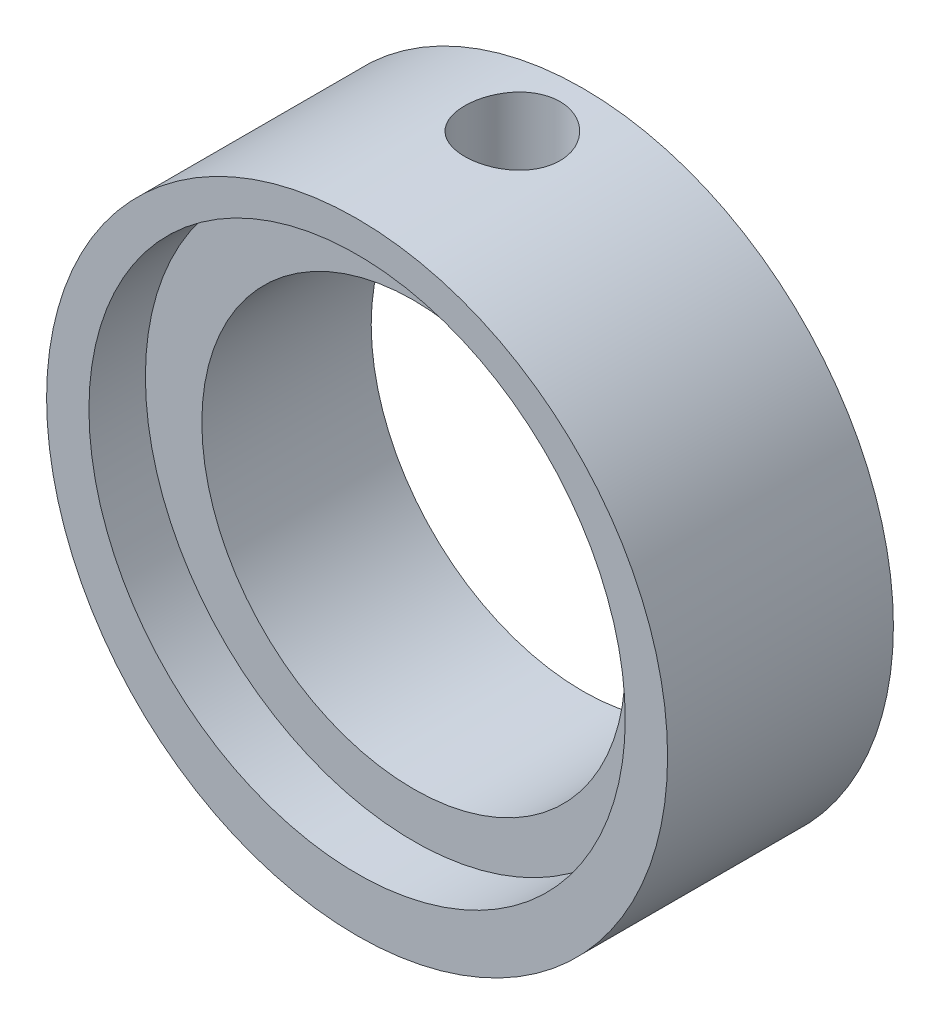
ISO-10303-21;
HEADER;
FILE_DESCRIPTION(('STEP AP214'),'2;1');
FILE_NAME('part.step','',(''),(''),'','','');
FILE_SCHEMA(('AUTOMOTIVE_DESIGN { 1 0 10303 214 1 1 1 1 }'));
ENDSEC;
DATA;
#1=APPLICATION_CONTEXT('core data for automotive mechanical design processes');
#2=APPLICATION_PROTOCOL_DEFINITION('international standard','automotive_design',2000,#1);
#3=PRODUCT_CONTEXT('',#1,'mechanical');
#4=PRODUCT('Part','Part','',(#3));
#5=PRODUCT_RELATED_PRODUCT_CATEGORY('part','',(#4));
#6=PRODUCT_DEFINITION_FORMATION('','',#4);
#7=PRODUCT_DEFINITION_CONTEXT('part definition',#1,'design');
#8=PRODUCT_DEFINITION('design','',#6,#7);
#9=PRODUCT_DEFINITION_SHAPE('','',#8);
#10=(LENGTH_UNIT() NAMED_UNIT(*) SI_UNIT(.MILLI.,.METRE.));
#11=(NAMED_UNIT(*) PLANE_ANGLE_UNIT() SI_UNIT($,.RADIAN.));
#12=(NAMED_UNIT(*) SI_UNIT($,.STERADIAN.) SOLID_ANGLE_UNIT());
#13=UNCERTAINTY_MEASURE_WITH_UNIT(LENGTH_MEASURE(1.E-05),#10,'distance_accuracy_value','');
#14=(GEOMETRIC_REPRESENTATION_CONTEXT(3) GLOBAL_UNCERTAINTY_ASSIGNED_CONTEXT((#13)) GLOBAL_UNIT_ASSIGNED_CONTEXT((#10,
#11,#12)) REPRESENTATION_CONTEXT('',''));
#15=CARTESIAN_POINT('',(0.,0.,0.));
#16=DIRECTION('',(0.,0.,1.));
#17=DIRECTION('',(1.,0.,0.));
#18=AXIS2_PLACEMENT_3D('',#15,#16,#17);
#19=CARTESIAN_POINT('',(0.,0.,16.));
#20=DIRECTION('',(0.,0.,-1.));
#21=DIRECTION('',(-1.,0.,0.));
#22=AXIS2_PLACEMENT_3D('',#19,#20,#21);
#23=CYLINDRICAL_SURFACE('',#22,15.);
#24=CARTESIAN_POINT('',(0.,0.,12.));
#25=DIRECTION('',(0.,0.,1.));
#26=DIRECTION('',(1.,0.,0.));
#27=AXIS2_PLACEMENT_3D('',#24,#25,#26);
#28=CIRCLE('',#27,15.);
#29=CARTESIAN_POINT('',(15.,0.,12.));
#30=VERTEX_POINT('',#29);
#31=EDGE_CURVE('E58',#30,#30,#28,.T.);
#32=ORIENTED_EDGE('',*,*,#31,.T.);
#33=EDGE_LOOP('',(#32));
#34=FACE_BOUND('',#33,.T.);
#35=CARTESIAN_POINT('',(0.,0.,0.));
#36=DIRECTION('',(0.,0.,1.));
#37=DIRECTION('',(1.,0.,0.));
#38=AXIS2_PLACEMENT_3D('',#35,#36,#37);
#39=CIRCLE('',#38,15.);
#40=CARTESIAN_POINT('',(15.,0.,0.));
#41=VERTEX_POINT('',#40);
#42=EDGE_CURVE('E47',#41,#41,#39,.T.);
#43=ORIENTED_EDGE('',*,*,#42,.F.);
#44=EDGE_LOOP('',(#43));
#45=FACE_BOUND('',#44,.T.);
#46=CARTESIAN_POINT('',(0.,15.,1.625));
#47=CARTESIAN_POINT('',(-0.187049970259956,14.9999965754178,1.62500619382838));
#48=CARTESIAN_POINT('',(-0.374173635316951,14.9964658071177,1.6406025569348));
#49=CARTESIAN_POINT('',(-0.743096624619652,14.9827220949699,1.70250573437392));
#50=CARTESIAN_POINT('',(-0.924892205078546,14.9725045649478,1.74883362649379));
#51=CARTESIAN_POINT('',(-1.27777480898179,14.9465237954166,1.87066811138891));
#52=CARTESIAN_POINT('',(-1.44887311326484,14.9307665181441,1.94614334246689));
#53=CARTESIAN_POINT('',(-1.77597364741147,14.8954025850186,2.12402838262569));
#54=CARTESIAN_POINT('',(-1.93197609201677,14.8757959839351,2.22643780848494));
#55=CARTESIAN_POINT('',(-2.22710112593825,14.8345066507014,2.45711745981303));
#56=CARTESIAN_POINT('',(-2.36593172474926,14.8127969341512,2.58575644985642));
#57=CARTESIAN_POINT('',(-2.62023917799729,14.76993620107,2.86445237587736));
#58=CARTESIAN_POINT('',(-2.73571385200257,14.7487852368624,3.01451130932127));
#59=CARTESIAN_POINT('',(-2.94133594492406,14.7091696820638,3.33396704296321));
#60=CARTESIAN_POINT('',(-3.03116951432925,14.6907396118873,3.50357052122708));
#61=CARTESIAN_POINT('',(-3.18094521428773,14.6590411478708,3.85595024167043));
#62=CARTESIAN_POINT('',(-3.24089114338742,14.6457720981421,4.0387248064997));
#63=CARTESIAN_POINT('',(-3.32821895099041,14.6261733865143,4.40908238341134));
#64=CARTESIAN_POINT('',(-3.35611938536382,14.6197333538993,4.59653715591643));
#65=CARTESIAN_POINT('',(-3.38017716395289,14.6141905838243,4.9735689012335));
#66=CARTESIAN_POINT('',(-3.37633864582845,14.6150868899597,5.16314559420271));
#67=CARTESIAN_POINT('',(-3.33744409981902,14.624015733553,5.53516251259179));
#68=CARTESIAN_POINT('',(-3.3029933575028,14.6319098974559,5.71766984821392));
#69=CARTESIAN_POINT('',(-3.20481250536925,14.653725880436,6.07424612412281));
#70=CARTESIAN_POINT('',(-3.14108066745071,14.6676480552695,6.24831456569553));
#71=CARTESIAN_POINT('',(-2.98559868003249,14.7000859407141,6.58475843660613));
#72=CARTESIAN_POINT('',(-2.89361830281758,14.7186391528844,6.74702370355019));
#73=CARTESIAN_POINT('',(-2.68441192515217,14.7582259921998,7.05403914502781));
#74=CARTESIAN_POINT('',(-2.56718229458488,14.7792599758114,7.19878679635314));
#75=CARTESIAN_POINT('',(-2.30761412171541,14.8220299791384,7.47014003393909));
#76=CARTESIAN_POINT('',(-2.16476159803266,14.8437710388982,7.59625367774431));
#77=CARTESIAN_POINT('',(-1.85968534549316,14.8850672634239,7.82281698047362));
#78=CARTESIAN_POINT('',(-1.6974612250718,14.9046223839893,7.92326612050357));
#79=CARTESIAN_POINT('',(-1.35762702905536,14.939412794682,8.09578163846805));
#80=CARTESIAN_POINT('',(-1.17998162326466,14.9546378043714,8.16778062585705));
#81=CARTESIAN_POINT('',(-0.814694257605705,14.978976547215,8.2807671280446));
#82=CARTESIAN_POINT('',(-0.627053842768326,14.988091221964,8.32175942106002));
#83=CARTESIAN_POINT('',(-0.251319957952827,14.9990472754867,8.37084660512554));
#84=CARTESIAN_POINT('',(-0.063318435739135,15.0010371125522,8.37961308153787));
#85=CARTESIAN_POINT('',(0.311463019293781,14.997936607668,8.36582421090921));
#86=CARTESIAN_POINT('',(0.498243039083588,14.9928467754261,8.34327111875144));
#87=CARTESIAN_POINT('',(0.863033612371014,14.9762528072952,8.26803967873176));
#88=CARTESIAN_POINT('',(1.04112111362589,14.9648242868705,8.21571628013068));
#89=CARTESIAN_POINT('',(1.38599025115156,14.9368333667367,8.08282564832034));
#90=CARTESIAN_POINT('',(1.5527708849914,14.9202705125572,8.00225591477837));
#91=CARTESIAN_POINT('',(1.87304917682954,14.883483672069,7.81377920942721));
#92=CARTESIAN_POINT('',(2.02631071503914,14.863208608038,7.70548119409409));
#93=CARTESIAN_POINT('',(2.31272577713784,14.8213456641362,7.46513408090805));
#94=CARTESIAN_POINT('',(2.44587652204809,14.7997576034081,7.33308170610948));
#95=CARTESIAN_POINT('',(2.69096738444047,14.7571847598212,7.04588481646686));
#96=CARTESIAN_POINT('',(2.80244117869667,14.7362200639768,6.89033880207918));
#97=CARTESIAN_POINT('',(2.99768862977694,14.6977483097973,6.56234047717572));
#98=CARTESIAN_POINT('',(3.08146350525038,14.6802410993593,6.38988891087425));
#99=CARTESIAN_POINT('',(3.21835399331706,14.6508396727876,6.03390992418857));
#100=CARTESIAN_POINT('',(3.27164531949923,14.6389133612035,5.85045285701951));
#101=CARTESIAN_POINT('',(3.34656287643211,14.6219704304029,5.47688292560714));
#102=CARTESIAN_POINT('',(3.36819451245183,14.6169526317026,5.28677120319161));
#103=CARTESIAN_POINT('',(3.37893828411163,14.6144722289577,4.90999803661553));
#104=CARTESIAN_POINT('',(3.36879081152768,14.6168376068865,4.72335846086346));
#105=CARTESIAN_POINT('',(3.31792710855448,14.6284663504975,4.35452253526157));
#106=CARTESIAN_POINT('',(3.27721128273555,14.6377296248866,4.17232612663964));
#107=CARTESIAN_POINT('',(3.16673365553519,14.6620241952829,3.81817789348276));
#108=CARTESIAN_POINT('',(3.09708556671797,14.6770328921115,3.64618894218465));
#109=CARTESIAN_POINT('',(2.93081601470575,14.7111348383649,3.31622936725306));
#110=CARTESIAN_POINT('',(2.83419155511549,14.730228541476,3.15826030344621));
#111=CARTESIAN_POINT('',(2.61428212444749,14.7708585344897,2.85718827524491));
#112=CARTESIAN_POINT('',(2.490472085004,14.7924382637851,2.71447462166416));
#113=CARTESIAN_POINT('',(2.22076251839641,14.8353235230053,2.45160683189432));
#114=CARTESIAN_POINT('',(2.07485787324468,14.8566289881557,2.33145793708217));
#115=CARTESIAN_POINT('',(1.76265478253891,14.8969170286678,2.11552454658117));
#116=CARTESIAN_POINT('',(1.59610099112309,14.9158631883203,2.0201020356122));
#117=CARTESIAN_POINT('',(1.24892247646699,14.9489294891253,1.85875905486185));
#118=CARTESIAN_POINT('',(1.06830937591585,14.9630535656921,1.79281451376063));
#119=CARTESIAN_POINT('',(0.7396697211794,14.9824450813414,1.70368423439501));
#120=CARTESIAN_POINT('',(0.593384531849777,14.9889865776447,1.67423531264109));
#121=CARTESIAN_POINT('',(0.298081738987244,14.9977652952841,1.63489121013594));
#122=CARTESIAN_POINT('',(0.149064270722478,15.0000027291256,1.62499506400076));
#123=CARTESIAN_POINT('',(0.,15.,1.625));
#124=B_SPLINE_CURVE_WITH_KNOTS('',3,(#46,#47,#48,#49,#50,#51,#52,#53,#54,#55,#56,#57,#58,#59,
#60,#61,#62,#63,#64,#65,#66,#67,#68,#69,#70,#71,#72,#73,#74,#75,#76,#77,#78,#79,#80,#81,#82,#83,
#84,#85,#86,#87,#88,#89,#90,#91,#92,#93,#94,#95,#96,#97,#98,#99,#100,#101,#102,#103,#104,#105,
#106,#107,#108,#109,#110,#111,#112,#113,#114,#115,#116,#117,#118,#119,#120,#121,#122,#123),
.UNSPECIFIED.,.T.,.F.,(4,2,2,2,2,2,2,2,2,2,2,2,2,2,2,2,2,2,2,2,2,2,2,2,2,2,2,2,2,2,2,2,2,2,2,2,
2,2,4),(0.,0.560604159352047,1.12159321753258,1.68198034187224,2.2423594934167,2.81124017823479,
3.38017394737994,3.95579900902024,4.53135089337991,5.09745190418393,5.66347911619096,
6.21855749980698,6.77366864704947,7.3334297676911,7.89327141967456,8.46594659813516,
9.038633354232,9.61266862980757,10.1866154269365,10.7485311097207,11.3104063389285,
11.8657186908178,12.4210802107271,12.9847523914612,13.5485023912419,14.1232900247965,
14.6980523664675,15.2694673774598,15.8407848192,16.3988915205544,16.9569908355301,
17.5129170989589,18.068905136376,18.6367612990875,19.2047492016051,19.7806343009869,
20.3560482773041,20.8028282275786,21.2495861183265),.UNSPECIFIED.);
#125=CARTESIAN_POINT('',(0.,15.,1.625));
#126=VERTEX_POINT('',#125);
#127=EDGE_CURVE('E61',#126,#126,#124,.T.);
#128=ORIENTED_EDGE('',*,*,#127,.T.);
#129=EDGE_LOOP('',(#128));
#130=FACE_BOUND('',#129,.T.);
#131=ADVANCED_FACE('F26',(#34,#45,#130),#23,.F.);
#132=CARTESIAN_POINT('',(0.,0.,16.));
#133=DIRECTION('',(0.,0.,-1.));
#134=DIRECTION('',(-1.,0.,0.));
#135=AXIS2_PLACEMENT_3D('',#132,#133,#134);
#136=CYLINDRICAL_SURFACE('',#135,22.);
#137=CARTESIAN_POINT('',(0.,0.,16.));
#138=DIRECTION('',(0.,0.,1.));
#139=DIRECTION('',(1.,0.,0.));
#140=AXIS2_PLACEMENT_3D('',#137,#138,#139);
#141=CIRCLE('',#140,22.);
#142=CARTESIAN_POINT('',(22.,0.,16.));
#143=VERTEX_POINT('',#142);
#144=EDGE_CURVE('E37',#143,#143,#141,.T.);
#145=ORIENTED_EDGE('',*,*,#144,.F.);
#146=EDGE_LOOP('',(#145));
#147=FACE_BOUND('',#146,.T.);
#148=CARTESIAN_POINT('',(0.,0.,0.));
#149=DIRECTION('',(0.,0.,1.));
#150=DIRECTION('',(1.,0.,0.));
#151=AXIS2_PLACEMENT_3D('',#148,#149,#150);
#152=CIRCLE('',#151,22.);
#153=CARTESIAN_POINT('',(22.,0.,0.));
#154=VERTEX_POINT('',#153);
#155=EDGE_CURVE('E42',#154,#154,#152,.T.);
#156=ORIENTED_EDGE('',*,*,#155,.T.);
#157=EDGE_LOOP('',(#156));
#158=FACE_BOUND('',#157,.T.);
#159=CARTESIAN_POINT('',(0.,22.,1.625));
#160=CARTESIAN_POINT('',(-0.188389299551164,21.999996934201,1.62500772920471));
#161=CARTESIAN_POINT('',(-0.376886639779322,21.9975548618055,1.64082682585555));
#162=CARTESIAN_POINT('',(-0.748609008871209,21.9880480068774,1.70366720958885));
#163=CARTESIAN_POINT('',(-0.931828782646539,21.9809787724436,1.75071854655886));
#164=CARTESIAN_POINT('',(-1.28756295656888,21.9630117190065,1.87458143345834));
#165=CARTESIAN_POINT('',(-1.46008546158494,21.952116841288,1.95137012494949));
#166=CARTESIAN_POINT('',(-1.78977112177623,21.9277012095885,2.13247130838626));
#167=CARTESIAN_POINT('',(-1.9469363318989,21.9141808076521,2.23678011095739));
#168=CARTESIAN_POINT('',(-2.24275340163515,21.8858934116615,2.47086674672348));
#169=CARTESIAN_POINT('',(-2.3812618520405,21.8711180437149,2.60082481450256));
#170=CARTESIAN_POINT('',(-2.63459605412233,21.8420512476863,2.8821330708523));
#171=CARTESIAN_POINT('',(-2.74942041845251,21.8277598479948,3.03348451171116));
#172=CARTESIAN_POINT('',(-2.95268854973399,21.8011978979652,3.3542510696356));
#173=CARTESIAN_POINT('',(-3.04099295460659,21.7889381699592,3.52375547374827));
#174=CARTESIAN_POINT('',(-3.18782380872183,21.7679423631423,3.87540971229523));
#175=CARTESIAN_POINT('',(-3.24635195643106,21.7592060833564,4.0575588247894));
#176=CARTESIAN_POINT('',(-3.33152222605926,21.7463288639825,4.42782126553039));
#177=CARTESIAN_POINT('',(-3.35841028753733,21.7421524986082,4.61587676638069));
#178=CARTESIAN_POINT('',(-3.38029915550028,21.7387604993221,4.99387325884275));
#179=CARTESIAN_POINT('',(-3.37530187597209,21.7395445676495,5.18381413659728));
#180=CARTESIAN_POINT('',(-3.33376277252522,21.7459524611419,5.55844873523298));
#181=CARTESIAN_POINT('',(-3.29749532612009,21.751534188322,5.74317370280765));
#182=CARTESIAN_POINT('',(-3.19487511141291,21.766842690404,6.10388506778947));
#183=CARTESIAN_POINT('',(-3.12852145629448,21.7765695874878,6.27987120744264));
#184=CARTESIAN_POINT('',(-2.96732840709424,21.7991187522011,6.61894148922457));
#185=CARTESIAN_POINT('',(-2.87237324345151,21.8119535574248,6.78196972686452));
#186=CARTESIAN_POINT('',(-2.6567550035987,21.8392633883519,7.08988265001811));
#187=CARTESIAN_POINT('',(-2.53609016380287,21.8537385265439,7.23476608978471));
#188=CARTESIAN_POINT('',(-2.27097389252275,21.8828838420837,7.50386651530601));
#189=CARTESIAN_POINT('',(-2.12628665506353,21.8975544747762,7.62785125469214));
#190=CARTESIAN_POINT('',(-1.81803519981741,21.9252971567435,7.84981477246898));
#191=CARTESIAN_POINT('',(-1.6544708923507,21.9383691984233,7.94779342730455));
#192=CARTESIAN_POINT('',(-1.31290363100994,21.9614564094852,8.11497726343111));
#193=CARTESIAN_POINT('',(-1.13489151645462,21.971469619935,8.18416401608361));
#194=CARTESIAN_POINT('',(-0.769587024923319,21.9872947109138,8.29159551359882));
#195=CARTESIAN_POINT('',(-0.582295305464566,21.9931068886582,8.32984244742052));
#196=CARTESIAN_POINT('',(-0.205752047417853,21.9998355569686,8.37399861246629));
#197=CARTESIAN_POINT('',(-0.0165387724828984,22.0008003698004,8.38022704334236));
#198=CARTESIAN_POINT('',(0.360229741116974,21.9978572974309,8.36101739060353));
#199=CARTESIAN_POINT('',(0.54778503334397,21.9939495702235,8.33558033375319));
#200=CARTESIAN_POINT('',(0.914942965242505,21.9817303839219,8.25402721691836));
#201=CARTESIAN_POINT('',(1.09458106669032,21.9734413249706,8.19806716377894));
#202=CARTESIAN_POINT('',(1.44192532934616,21.9533857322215,8.05722142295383));
#203=CARTESIAN_POINT('',(1.60963090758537,21.9416190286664,7.97233432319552));
#204=CARTESIAN_POINT('',(1.92974982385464,21.9157952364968,7.77529876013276));
#205=CARTESIAN_POINT('',(2.08203753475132,21.9017214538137,7.66294842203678));
#206=CARTESIAN_POINT('',(2.36571070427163,21.8729005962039,7.41445599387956));
#207=CARTESIAN_POINT('',(2.49709488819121,21.8581534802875,7.27831245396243));
#208=CARTESIAN_POINT('',(2.73639723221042,21.8294942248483,6.98467509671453));
#209=CARTESIAN_POINT('',(2.84410108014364,21.8155904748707,6.82700567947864));
#210=CARTESIAN_POINT('',(3.03149438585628,21.7903423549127,6.49562549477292));
#211=CARTESIAN_POINT('',(3.11118462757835,21.7789979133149,6.32191517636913));
#212=CARTESIAN_POINT('',(3.23995872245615,21.7602140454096,5.96401541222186));
#213=CARTESIAN_POINT('',(3.28915415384,21.7527603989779,5.77986689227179));
#214=CARTESIAN_POINT('',(3.35589652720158,21.7425646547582,5.40579808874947));
#215=CARTESIAN_POINT('',(3.37344576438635,21.7398222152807,5.21587822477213));
#216=CARTESIAN_POINT('',(3.37634113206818,21.7393725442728,4.83779471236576));
#217=CARTESIAN_POINT('',(3.36202429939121,21.7416126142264,4.64963362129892));
#218=CARTESIAN_POINT('',(3.30231746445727,21.7507608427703,4.27842941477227));
#219=CARTESIAN_POINT('',(3.25692752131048,21.7576689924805,4.09538628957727));
#220=CARTESIAN_POINT('',(3.13648408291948,21.7753562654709,3.73971461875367));
#221=CARTESIAN_POINT('',(3.06145522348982,21.7861321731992,3.56707756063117));
#222=CARTESIAN_POINT('',(2.88389747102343,21.8103445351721,3.23678706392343));
#223=CARTESIAN_POINT('',(2.78136756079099,21.8237810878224,3.07913417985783));
#224=CARTESIAN_POINT('',(2.55049786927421,21.8519697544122,2.78157667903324));
#225=CARTESIAN_POINT('',(2.42190877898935,21.8667337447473,2.64186659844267));
#226=CARTESIAN_POINT('',(2.14309777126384,21.8958154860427,2.38588891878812));
#227=CARTESIAN_POINT('',(1.99287084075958,21.9101331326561,2.26962676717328));
#228=CARTESIAN_POINT('',(1.67402598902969,21.9368036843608,2.06324265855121));
#229=CARTESIAN_POINT('',(1.50530691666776,21.949144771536,1.97327546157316));
#230=CARTESIAN_POINT('',(1.15504027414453,21.9703560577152,1.82309230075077));
#231=CARTESIAN_POINT('',(0.973506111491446,21.979229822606,1.76284575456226));
#232=CARTESIAN_POINT('',(0.659315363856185,21.9904984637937,1.68736626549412));
#233=CARTESIAN_POINT('',(0.528590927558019,21.9940430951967,1.66401499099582));
#234=CARTESIAN_POINT('',(0.265262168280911,21.998794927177,1.63282924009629));
#235=CARTESIAN_POINT('',(0.132657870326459,22.0000021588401,1.62499455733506));
#236=CARTESIAN_POINT('',(0.,22.,1.625));
#237=B_SPLINE_CURVE_WITH_KNOTS('',3,(#159,#160,#161,#162,#163,#164,#165,#166,#167,#168,#169,
#170,#171,#172,#173,#174,#175,#176,#177,#178,#179,#180,#181,#182,#183,#184,#185,#186,#187,#188,
#189,#190,#191,#192,#193,#194,#195,#196,#197,#198,#199,#200,#201,#202,#203,#204,#205,#206,#207,
#208,#209,#210,#211,#212,#213,#214,#215,#216,#217,#218,#219,#220,#221,#222,#223,#224,#225,#226,
#227,#228,#229,#230,#231,#232,#233,#234,#235,#236),.UNSPECIFIED.,.T.,.F.,(4,2,2,2,2,2,2,2,2,2,2,
2,2,2,2,2,2,2,2,2,2,2,2,2,2,2,2,2,2,2,2,2,2,2,2,2,2,2,4),(0.,0.564683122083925,1.12991033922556,
1.69470393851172,2.25942185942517,2.82825913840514,3.39712972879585,3.96893942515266,
4.54071650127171,5.10801914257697,5.67528773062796,6.23762894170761,6.79998672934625,
7.36465206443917,7.92935614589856,8.49997235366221,9.07059127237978,9.64157486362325,
10.2125180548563,10.7777581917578,11.3429800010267,11.9053395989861,12.4677266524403,
13.0343790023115,13.6010658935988,14.1726876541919,14.7442934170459,15.3137951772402,
15.8832556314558,16.4467217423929,17.0101867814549,17.5731844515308,18.1362029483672,
18.7048863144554,19.2737016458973,19.8458002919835,20.417309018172,20.8149465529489,
21.2125787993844),.UNSPECIFIED.);
#238=CARTESIAN_POINT('',(0.,22.,1.625));
#239=VERTEX_POINT('',#238);
#240=EDGE_CURVE('E10',#239,#239,#237,.T.);
#241=ORIENTED_EDGE('',*,*,#240,.F.);
#242=EDGE_LOOP('',(#241));
#243=FACE_BOUND('',#242,.T.);
#244=ADVANCED_FACE('F28',(#147,#158,#243),#136,.T.);
#245=CARTESIAN_POINT('',(0.,0.,16.));
#246=DIRECTION('',(0.,0.,1.));
#247=DIRECTION('',(1.,0.,0.));
#248=AXIS2_PLACEMENT_3D('',#245,#246,#247);
#249=PLANE('',#248);
#250=CARTESIAN_POINT('',(0.,0.8,16.));
#251=DIRECTION('',(0.,0.,1.));
#252=DIRECTION('',(1.,0.,0.));
#253=AXIS2_PLACEMENT_3D('',#250,#251,#252);
#254=CIRCLE('',#253,19.);
#255=CARTESIAN_POINT('',(19.,0.8,16.));
#256=VERTEX_POINT('',#255);
#257=EDGE_CURVE('E55',#256,#256,#254,.T.);
#258=ORIENTED_EDGE('',*,*,#257,.F.);
#259=EDGE_LOOP('',(#258));
#260=FACE_BOUND('',#259,.T.);
#261=ORIENTED_EDGE('',*,*,#144,.T.);
#262=EDGE_LOOP('',(#261));
#263=FACE_BOUND('',#262,.T.);
#264=ADVANCED_FACE('F85',(#260,#263),#249,.T.);
#265=CARTESIAN_POINT('',(0.,0.,0.));
#266=DIRECTION('',(0.,0.,1.));
#267=DIRECTION('',(1.,0.,0.));
#268=AXIS2_PLACEMENT_3D('',#265,#266,#267);
#269=PLANE('',#268);
#270=ORIENTED_EDGE('',*,*,#155,.F.);
#271=EDGE_LOOP('',(#270));
#272=FACE_BOUND('',#271,.T.);
#273=ORIENTED_EDGE('',*,*,#42,.T.);
#274=EDGE_LOOP('',(#273));
#275=FACE_BOUND('',#274,.T.);
#276=ADVANCED_FACE('F80',(#272,#275),#269,.F.);
#277=CARTESIAN_POINT('',(0.,0.8,12.));
#278=DIRECTION('',(0.,0.,1.));
#279=DIRECTION('',(1.,0.,0.));
#280=AXIS2_PLACEMENT_3D('',#277,#278,#279);
#281=CYLINDRICAL_SURFACE('',#280,19.);
#282=CARTESIAN_POINT('',(0.,0.8,12.));
#283=DIRECTION('',(0.,0.,1.));
#284=DIRECTION('',(1.,0.,0.));
#285=AXIS2_PLACEMENT_3D('',#282,#283,#284);
#286=CIRCLE('',#285,19.);
#287=CARTESIAN_POINT('',(19.,0.8,12.));
#288=VERTEX_POINT('',#287);
#289=EDGE_CURVE('E52',#288,#288,#286,.T.);
#290=ORIENTED_EDGE('',*,*,#289,.F.);
#291=EDGE_LOOP('',(#290));
#292=FACE_BOUND('',#291,.T.);
#293=ORIENTED_EDGE('',*,*,#257,.T.);
#294=EDGE_LOOP('',(#293));
#295=FACE_BOUND('',#294,.T.);
#296=ADVANCED_FACE('F77',(#292,#295),#281,.F.);
#297=CARTESIAN_POINT('',(0.,0.8,12.));
#298=DIRECTION('',(0.,0.,1.));
#299=DIRECTION('',(1.,0.,0.));
#300=AXIS2_PLACEMENT_3D('',#297,#298,#299);
#301=PLANE('',#300);
#302=ORIENTED_EDGE('',*,*,#31,.F.);
#303=EDGE_LOOP('',(#302));
#304=FACE_BOUND('',#303,.T.);
#305=ORIENTED_EDGE('',*,*,#289,.T.);
#306=EDGE_LOOP('',(#305));
#307=FACE_BOUND('',#306,.T.);
#308=ADVANCED_FACE('F73',(#304,#307),#301,.T.);
#309=CARTESIAN_POINT('',(0.,22.,5.));
#310=DIRECTION('',(0.,-1.,0.));
#311=DIRECTION('',(0.,0.,-1.));
#312=AXIS2_PLACEMENT_3D('',#309,#310,#311);
#313=CYLINDRICAL_SURFACE('',#312,3.375);
#314=ORIENTED_EDGE('',*,*,#127,.F.);
#315=EDGE_LOOP('',(#314));
#316=FACE_BOUND('',#315,.T.);
#317=ORIENTED_EDGE('',*,*,#240,.T.);
#318=EDGE_LOOP('',(#317));
#319=FACE_BOUND('',#318,.T.);
#320=ADVANCED_FACE('F69',(#316,#319),#313,.F.);
#321=CLOSED_SHELL('',(#131,#244,#264,#276,#296,#308,#320));
#322=MANIFOLD_SOLID_BREP('B2',#321);
#323=ADVANCED_BREP_SHAPE_REPRESENTATION('',(#18,#322),#14);
#324=SHAPE_DEFINITION_REPRESENTATION(#9,#323);
ENDSEC;
END-ISO-10303-21;
